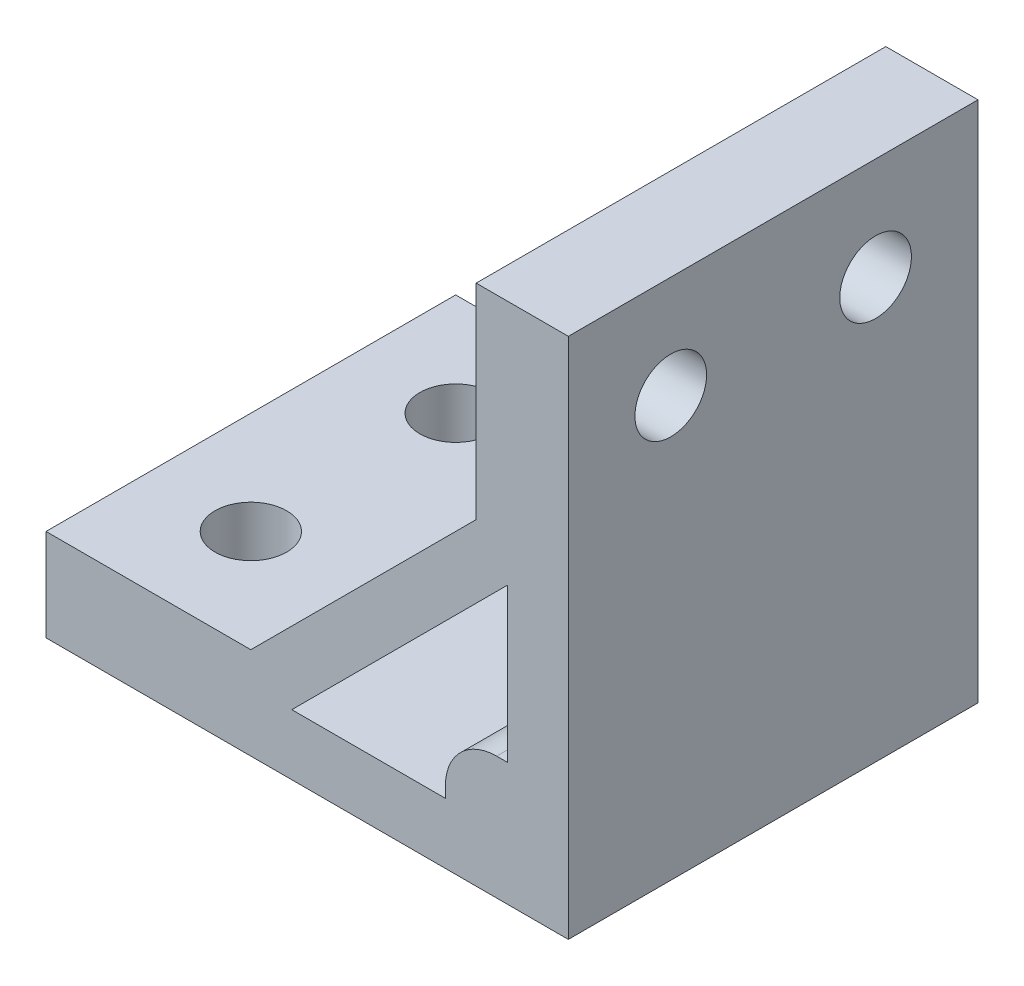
ISO-10303-21;
HEADER;
FILE_DESCRIPTION(('STEP AP214'),'2;1');
FILE_NAME('part.step','',(''),(''),'','','');
FILE_SCHEMA(('AUTOMOTIVE_DESIGN { 1 0 10303 214 1 1 1 1 }'));
ENDSEC;
DATA;
#1=APPLICATION_CONTEXT('core data for automotive mechanical design processes');
#2=APPLICATION_PROTOCOL_DEFINITION('international standard','automotive_design',2000,#1);
#3=PRODUCT_CONTEXT('',#1,'mechanical');
#4=PRODUCT('Part','Part','',(#3));
#5=PRODUCT_RELATED_PRODUCT_CATEGORY('part','',(#4));
#6=PRODUCT_DEFINITION_FORMATION('','',#4);
#7=PRODUCT_DEFINITION_CONTEXT('part definition',#1,'design');
#8=PRODUCT_DEFINITION('design','',#6,#7);
#9=PRODUCT_DEFINITION_SHAPE('','',#8);
#10=(LENGTH_UNIT() NAMED_UNIT(*) SI_UNIT(.MILLI.,.METRE.));
#11=(NAMED_UNIT(*) PLANE_ANGLE_UNIT() SI_UNIT($,.RADIAN.));
#12=(NAMED_UNIT(*) SI_UNIT($,.STERADIAN.) SOLID_ANGLE_UNIT());
#13=UNCERTAINTY_MEASURE_WITH_UNIT(LENGTH_MEASURE(1.E-05),#10,'distance_accuracy_value','');
#14=(GEOMETRIC_REPRESENTATION_CONTEXT(3) GLOBAL_UNCERTAINTY_ASSIGNED_CONTEXT((#13)) GLOBAL_UNIT_ASSIGNED_CONTEXT((#10,
#11,#12)) REPRESENTATION_CONTEXT('',''));
#15=CARTESIAN_POINT('',(0.,0.,0.));
#16=DIRECTION('',(0.,0.,1.));
#17=DIRECTION('',(1.,0.,0.));
#18=AXIS2_PLACEMENT_3D('',#15,#16,#17);
#19=CARTESIAN_POINT('',(0.,0.,40.));
#20=DIRECTION('',(0.,0.,1.));
#21=DIRECTION('',(1.,0.,0.));
#22=AXIS2_PLACEMENT_3D('',#19,#20,#21);
#23=PLANE('',#22);
#24=DIRECTION('',(1.,0.,0.));
#25=VECTOR('',#24,1.);
#26=CARTESIAN_POINT('',(-51.,0.,40.));
#27=LINE('',#26,#25);
#28=CARTESIAN_POINT('',(-51.,0.,40.));
#29=VERTEX_POINT('',#28);
#30=CARTESIAN_POINT('',(0.,0.,40.));
#31=VERTEX_POINT('',#30);
#32=EDGE_CURVE('E176',#29,#31,#27,.T.);
#33=ORIENTED_EDGE('',*,*,#32,.T.);
#34=DIRECTION('',(0.,1.,0.));
#35=VECTOR('',#34,1.);
#36=CARTESIAN_POINT('',(0.,0.,40.));
#37=LINE('',#36,#35);
#38=CARTESIAN_POINT('',(0.,51.,40.));
#39=VERTEX_POINT('',#38);
#40=EDGE_CURVE('E179',#31,#39,#37,.T.);
#41=ORIENTED_EDGE('',*,*,#40,.T.);
#42=DIRECTION('',(-1.,0.,0.));
#43=VECTOR('',#42,1.);
#44=CARTESIAN_POINT('',(0.,51.,40.));
#45=LINE('',#44,#43);
#46=CARTESIAN_POINT('',(-9.,51.,40.));
#47=VERTEX_POINT('',#46);
#48=EDGE_CURVE('E182',#39,#47,#45,.T.);
#49=ORIENTED_EDGE('',*,*,#48,.T.);
#50=DIRECTION('',(0.,-1.,0.));
#51=VECTOR('',#50,1.);
#52=CARTESIAN_POINT('',(-9.,51.,40.));
#53=LINE('',#52,#51);
#54=CARTESIAN_POINT('',(-9.,30.9999999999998,40.));
#55=VERTEX_POINT('',#54);
#56=EDGE_CURVE('E184',#47,#55,#53,.T.);
#57=ORIENTED_EDGE('',*,*,#56,.T.);
#58=DIRECTION('',(-0.707106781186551,-0.707106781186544,0.));
#59=VECTOR('',#58,1.);
#60=CARTESIAN_POINT('',(-9.,30.9999999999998,40.));
#61=LINE('',#60,#59);
#62=CARTESIAN_POINT('',(-31.,9.,40.));
#63=VERTEX_POINT('',#62);
#64=EDGE_CURVE('E186',#55,#63,#61,.T.);
#65=ORIENTED_EDGE('',*,*,#64,.T.);
#66=DIRECTION('',(-1.,0.,0.));
#67=VECTOR('',#66,1.);
#68=CARTESIAN_POINT('',(-31.,9.,40.));
#69=LINE('',#68,#67);
#70=CARTESIAN_POINT('',(-51.,9.,40.));
#71=VERTEX_POINT('',#70);
#72=EDGE_CURVE('E188',#63,#71,#69,.T.);
#73=ORIENTED_EDGE('',*,*,#72,.T.);
#74=DIRECTION('',(0.,-1.,0.));
#75=VECTOR('',#74,1.);
#76=CARTESIAN_POINT('',(-51.,9.,40.));
#77=LINE('',#76,#75);
#78=EDGE_CURVE('E190',#71,#29,#77,.T.);
#79=ORIENTED_EDGE('',*,*,#78,.T.);
#80=EDGE_LOOP('',(#33,#41,#49,#57,#65,#73,#79));
#81=FACE_BOUND('',#80,.T.);
#82=DIRECTION('',(1.,0.,0.));
#83=VECTOR('',#82,1.);
#84=CARTESIAN_POINT('',(-12.,12.,40.));
#85=LINE('',#84,#83);
#86=CARTESIAN_POINT('',(-7.,12.,40.));
#87=VERTEX_POINT('',#86);
#88=CARTESIAN_POINT('',(-5.92893218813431,12.,40.));
#89=VERTEX_POINT('',#88);
#90=EDGE_CURVE('E150',#87,#89,#85,.T.);
#91=ORIENTED_EDGE('',*,*,#90,.F.);
#92=CARTESIAN_POINT('',(-7.,7.,40.));
#93=DIRECTION('',(0.,0.,1.));
#94=DIRECTION('',(1.,0.,0.));
#95=AXIS2_PLACEMENT_3D('',#92,#93,#94);
#96=CIRCLE('',#95,5.);
#97=CARTESIAN_POINT('',(-12.,7.,40.));
#98=VERTEX_POINT('',#97);
#99=EDGE_CURVE('E11',#87,#98,#96,.T.);
#100=ORIENTED_EDGE('',*,*,#99,.T.);
#101=DIRECTION('',(0.,1.,0.));
#102=VECTOR('',#101,1.);
#103=CARTESIAN_POINT('',(-12.,5.92893218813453,40.));
#104=LINE('',#103,#102);
#105=CARTESIAN_POINT('',(-12.,5.92893218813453,40.));
#106=VERTEX_POINT('',#105);
#107=EDGE_CURVE('E137',#106,#98,#104,.T.);
#108=ORIENTED_EDGE('',*,*,#107,.F.);
#109=DIRECTION('',(1.,0.,0.));
#110=VECTOR('',#109,1.);
#111=CARTESIAN_POINT('',(-27.,5.92893218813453,40.));
#112=LINE('',#111,#110);
#113=CARTESIAN_POINT('',(-27.,5.92893218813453,40.));
#114=VERTEX_POINT('',#113);
#115=EDGE_CURVE('E127',#114,#106,#112,.T.);
#116=ORIENTED_EDGE('',*,*,#115,.F.);
#117=DIRECTION('',(-0.707106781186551,-0.707106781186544,0.));
#118=VECTOR('',#117,1.);
#119=CARTESIAN_POINT('',(-5.92893218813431,27.,40.));
#120=LINE('',#119,#118);
#121=CARTESIAN_POINT('',(-5.92893218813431,27.,40.));
#122=VERTEX_POINT('',#121);
#123=EDGE_CURVE('E158',#122,#114,#120,.T.);
#124=ORIENTED_EDGE('',*,*,#123,.F.);
#125=DIRECTION('',(0.,1.,0.));
#126=VECTOR('',#125,1.);
#127=CARTESIAN_POINT('',(-5.92893218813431,12.,40.));
#128=LINE('',#127,#126);
#129=EDGE_CURVE('E152',#89,#122,#128,.T.);
#130=ORIENTED_EDGE('',*,*,#129,.F.);
#131=EDGE_LOOP('',(#91,#100,#108,#116,#124,#130));
#132=FACE_BOUND('',#131,.T.);
#133=ADVANCED_FACE('F31',(#81,#132),#23,.T.);
#134=CARTESIAN_POINT('',(0.,0.,0.));
#135=DIRECTION('',(0.,0.,1.));
#136=DIRECTION('',(1.,0.,0.));
#137=AXIS2_PLACEMENT_3D('',#134,#135,#136);
#138=PLANE('',#137);
#139=DIRECTION('',(1.,0.,0.));
#140=VECTOR('',#139,1.);
#141=CARTESIAN_POINT('',(-51.,0.,0.));
#142=LINE('',#141,#140);
#143=CARTESIAN_POINT('',(-51.,0.,0.));
#144=VERTEX_POINT('',#143);
#145=CARTESIAN_POINT('',(0.,0.,0.));
#146=VERTEX_POINT('',#145);
#147=EDGE_CURVE('E146',#144,#146,#142,.T.);
#148=ORIENTED_EDGE('',*,*,#147,.F.);
#149=DIRECTION('',(0.,-1.,0.));
#150=VECTOR('',#149,1.);
#151=CARTESIAN_POINT('',(-51.,9.,0.));
#152=LINE('',#151,#150);
#153=CARTESIAN_POINT('',(-51.,9.,0.));
#154=VERTEX_POINT('',#153);
#155=EDGE_CURVE('E180',#154,#144,#152,.T.);
#156=ORIENTED_EDGE('',*,*,#155,.F.);
#157=DIRECTION('',(-1.,0.,0.));
#158=VECTOR('',#157,1.);
#159=CARTESIAN_POINT('',(-31.,9.,0.));
#160=LINE('',#159,#158);
#161=CARTESIAN_POINT('',(-31.,9.,0.));
#162=VERTEX_POINT('',#161);
#163=EDGE_CURVE('E203',#162,#154,#160,.T.);
#164=ORIENTED_EDGE('',*,*,#163,.F.);
#165=DIRECTION('',(-0.707106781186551,-0.707106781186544,0.));
#166=VECTOR('',#165,1.);
#167=CARTESIAN_POINT('',(-9.,30.9999999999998,0.));
#168=LINE('',#167,#166);
#169=CARTESIAN_POINT('',(-9.,30.9999999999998,0.));
#170=VERTEX_POINT('',#169);
#171=EDGE_CURVE('E201',#170,#162,#168,.T.);
#172=ORIENTED_EDGE('',*,*,#171,.F.);
#173=DIRECTION('',(0.,-1.,0.));
#174=VECTOR('',#173,1.);
#175=CARTESIAN_POINT('',(-9.,51.,0.));
#176=LINE('',#175,#174);
#177=CARTESIAN_POINT('',(-9.,51.,0.));
#178=VERTEX_POINT('',#177);
#179=EDGE_CURVE('E199',#178,#170,#176,.T.);
#180=ORIENTED_EDGE('',*,*,#179,.F.);
#181=DIRECTION('',(-1.,0.,0.));
#182=VECTOR('',#181,1.);
#183=CARTESIAN_POINT('',(0.,51.,0.));
#184=LINE('',#183,#182);
#185=CARTESIAN_POINT('',(0.,51.,0.));
#186=VERTEX_POINT('',#185);
#187=EDGE_CURVE('E197',#186,#178,#184,.T.);
#188=ORIENTED_EDGE('',*,*,#187,.F.);
#189=DIRECTION('',(0.,1.,0.));
#190=VECTOR('',#189,1.);
#191=CARTESIAN_POINT('',(0.,0.,0.));
#192=LINE('',#191,#190);
#193=EDGE_CURVE('E195',#146,#186,#192,.T.);
#194=ORIENTED_EDGE('',*,*,#193,.F.);
#195=EDGE_LOOP('',(#148,#156,#164,#172,#180,#188,#194));
#196=FACE_BOUND('',#195,.T.);
#197=DIRECTION('',(0.,1.,0.));
#198=VECTOR('',#197,1.);
#199=CARTESIAN_POINT('',(-12.,5.92893218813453,0.));
#200=LINE('',#199,#198);
#201=CARTESIAN_POINT('',(-12.,5.92893218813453,0.));
#202=VERTEX_POINT('',#201);
#203=CARTESIAN_POINT('',(-12.,7.,0.));
#204=VERTEX_POINT('',#203);
#205=EDGE_CURVE('E145',#202,#204,#200,.T.);
#206=ORIENTED_EDGE('',*,*,#205,.T.);
#207=CARTESIAN_POINT('',(-7.,7.,0.));
#208=DIRECTION('',(0.,0.,1.));
#209=DIRECTION('',(1.,0.,0.));
#210=AXIS2_PLACEMENT_3D('',#207,#208,#209);
#211=CIRCLE('',#210,5.);
#212=CARTESIAN_POINT('',(-7.,12.,0.));
#213=VERTEX_POINT('',#212);
#214=EDGE_CURVE('E55',#204,#213,#211,.F.);
#215=ORIENTED_EDGE('',*,*,#214,.T.);
#216=DIRECTION('',(1.,0.,0.));
#217=VECTOR('',#216,1.);
#218=CARTESIAN_POINT('',(-12.,12.,0.));
#219=LINE('',#218,#217);
#220=CARTESIAN_POINT('',(-5.92893218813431,12.,0.));
#221=VERTEX_POINT('',#220);
#222=EDGE_CURVE('E164',#213,#221,#219,.T.);
#223=ORIENTED_EDGE('',*,*,#222,.T.);
#224=DIRECTION('',(0.,1.,0.));
#225=VECTOR('',#224,1.);
#226=CARTESIAN_POINT('',(-5.92893218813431,12.,0.));
#227=LINE('',#226,#225);
#228=CARTESIAN_POINT('',(-5.92893218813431,27.,0.));
#229=VERTEX_POINT('',#228);
#230=EDGE_CURVE('E166',#221,#229,#227,.T.);
#231=ORIENTED_EDGE('',*,*,#230,.T.);
#232=DIRECTION('',(-0.707106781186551,-0.707106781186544,0.));
#233=VECTOR('',#232,1.);
#234=CARTESIAN_POINT('',(-5.92893218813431,27.,0.));
#235=LINE('',#234,#233);
#236=CARTESIAN_POINT('',(-27.,5.92893218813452,0.));
#237=VERTEX_POINT('',#236);
#238=EDGE_CURVE('E138',#229,#237,#235,.T.);
#239=ORIENTED_EDGE('',*,*,#238,.T.);
#240=DIRECTION('',(1.,0.,0.));
#241=VECTOR('',#240,1.);
#242=CARTESIAN_POINT('',(-27.,5.92893218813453,0.));
#243=LINE('',#242,#241);
#244=EDGE_CURVE('E160',#237,#202,#243,.T.);
#245=ORIENTED_EDGE('',*,*,#244,.T.);
#246=EDGE_LOOP('',(#206,#215,#223,#231,#239,#245));
#247=FACE_BOUND('',#246,.T.);
#248=ADVANCED_FACE('F272',(#196,#247),#138,.F.);
#249=CARTESIAN_POINT('',(-51.,0.,40.));
#250=DIRECTION('',(0.,1.,0.));
#251=DIRECTION('',(0.,0.,1.));
#252=AXIS2_PLACEMENT_3D('',#249,#250,#251);
#253=PLANE('',#252);
#254=CARTESIAN_POINT('',(-41.,0.,30.));
#255=DIRECTION('',(0.,-1.,0.));
#256=DIRECTION('',(0.,0.,-1.));
#257=AXIS2_PLACEMENT_3D('',#254,#255,#256);
#258=CIRCLE('',#257,3.5);
#259=CARTESIAN_POINT('',(-41.,0.,26.5));
#260=VERTEX_POINT('',#259);
#261=EDGE_CURVE('E248',#260,#260,#258,.T.);
#262=ORIENTED_EDGE('',*,*,#261,.F.);
#263=EDGE_LOOP('',(#262));
#264=FACE_BOUND('',#263,.T.);
#265=CARTESIAN_POINT('',(-41.,0.,10.));
#266=DIRECTION('',(0.,-1.,0.));
#267=DIRECTION('',(0.,0.,-1.));
#268=AXIS2_PLACEMENT_3D('',#265,#266,#267);
#269=CIRCLE('',#268,3.5);
#270=CARTESIAN_POINT('',(-41.,0.,6.5));
#271=VERTEX_POINT('',#270);
#272=EDGE_CURVE('E238',#271,#271,#269,.T.);
#273=ORIENTED_EDGE('',*,*,#272,.F.);
#274=EDGE_LOOP('',(#273));
#275=FACE_BOUND('',#274,.T.);
#276=ORIENTED_EDGE('',*,*,#147,.T.);
#277=DIRECTION('',(0.,0.,-1.));
#278=VECTOR('',#277,1.);
#279=CARTESIAN_POINT('',(0.,0.,40.));
#280=LINE('',#279,#278);
#281=EDGE_CURVE('E223',#31,#146,#280,.T.);
#282=ORIENTED_EDGE('',*,*,#281,.F.);
#283=ORIENTED_EDGE('',*,*,#32,.F.);
#284=DIRECTION('',(0.,0.,-1.));
#285=VECTOR('',#284,1.);
#286=CARTESIAN_POINT('',(-51.,0.,40.));
#287=LINE('',#286,#285);
#288=EDGE_CURVE('E192',#29,#144,#287,.T.);
#289=ORIENTED_EDGE('',*,*,#288,.T.);
#290=EDGE_LOOP('',(#276,#282,#283,#289));
#291=FACE_BOUND('',#290,.T.);
#292=ADVANCED_FACE('F260',(#264,#275,#291),#253,.F.);
#293=CARTESIAN_POINT('',(0.,0.,40.));
#294=DIRECTION('',(-1.,0.,0.));
#295=DIRECTION('',(0.,0.,1.));
#296=AXIS2_PLACEMENT_3D('',#293,#294,#295);
#297=PLANE('',#296);
#298=CARTESIAN_POINT('',(0.,41.,30.));
#299=DIRECTION('',(1.,0.,0.));
#300=DIRECTION('',(0.,0.,-1.));
#301=AXIS2_PLACEMENT_3D('',#298,#299,#300);
#302=CIRCLE('',#301,3.5);
#303=CARTESIAN_POINT('',(0.,41.,26.5));
#304=VERTEX_POINT('',#303);
#305=EDGE_CURVE('E235',#304,#304,#302,.T.);
#306=ORIENTED_EDGE('',*,*,#305,.F.);
#307=EDGE_LOOP('',(#306));
#308=FACE_BOUND('',#307,.T.);
#309=CARTESIAN_POINT('',(0.,41.,10.));
#310=DIRECTION('',(1.,0.,0.));
#311=DIRECTION('',(0.,0.,-1.));
#312=AXIS2_PLACEMENT_3D('',#309,#310,#311);
#313=CIRCLE('',#312,3.5);
#314=CARTESIAN_POINT('',(0.,41.,6.5));
#315=VERTEX_POINT('',#314);
#316=EDGE_CURVE('E232',#315,#315,#313,.T.);
#317=ORIENTED_EDGE('',*,*,#316,.F.);
#318=EDGE_LOOP('',(#317));
#319=FACE_BOUND('',#318,.T.);
#320=ORIENTED_EDGE('',*,*,#193,.T.);
#321=DIRECTION('',(0.,0.,-1.));
#322=VECTOR('',#321,1.);
#323=CARTESIAN_POINT('',(0.,51.,40.));
#324=LINE('',#323,#322);
#325=EDGE_CURVE('E220',#39,#186,#324,.T.);
#326=ORIENTED_EDGE('',*,*,#325,.F.);
#327=ORIENTED_EDGE('',*,*,#40,.F.);
#328=ORIENTED_EDGE('',*,*,#281,.T.);
#329=EDGE_LOOP('',(#320,#326,#327,#328));
#330=FACE_BOUND('',#329,.T.);
#331=ADVANCED_FACE('F256',(#308,#319,#330),#297,.F.);
#332=CARTESIAN_POINT('',(0.,51.,40.));
#333=DIRECTION('',(0.,-1.,0.));
#334=DIRECTION('',(0.,0.,-1.));
#335=AXIS2_PLACEMENT_3D('',#332,#333,#334);
#336=PLANE('',#335);
#337=ORIENTED_EDGE('',*,*,#187,.T.);
#338=DIRECTION('',(0.,0.,-1.));
#339=VECTOR('',#338,1.);
#340=CARTESIAN_POINT('',(-9.,51.,40.));
#341=LINE('',#340,#339);
#342=EDGE_CURVE('E217',#47,#178,#341,.T.);
#343=ORIENTED_EDGE('',*,*,#342,.F.);
#344=ORIENTED_EDGE('',*,*,#48,.F.);
#345=ORIENTED_EDGE('',*,*,#325,.T.);
#346=EDGE_LOOP('',(#337,#343,#344,#345));
#347=FACE_BOUND('',#346,.T.);
#348=ADVANCED_FACE('F259',(#347),#336,.F.);
#349=CARTESIAN_POINT('',(-9.,51.,40.));
#350=DIRECTION('',(1.,0.,0.));
#351=DIRECTION('',(0.,1.,0.));
#352=AXIS2_PLACEMENT_3D('',#349,#350,#351);
#353=PLANE('',#352);
#354=CARTESIAN_POINT('',(-9.,41.,30.));
#355=DIRECTION('',(1.,0.,0.));
#356=DIRECTION('',(0.,1.,0.));
#357=AXIS2_PLACEMENT_3D('',#354,#355,#356);
#358=CIRCLE('',#357,3.5);
#359=CARTESIAN_POINT('',(-9.,44.5,30.));
#360=VERTEX_POINT('',#359);
#361=EDGE_CURVE('E233',#360,#360,#358,.T.);
#362=ORIENTED_EDGE('',*,*,#361,.T.);
#363=EDGE_LOOP('',(#362));
#364=FACE_BOUND('',#363,.T.);
#365=CARTESIAN_POINT('',(-9.,41.,10.));
#366=DIRECTION('',(1.,0.,0.));
#367=DIRECTION('',(0.,1.,0.));
#368=AXIS2_PLACEMENT_3D('',#365,#366,#367);
#369=CIRCLE('',#368,3.5);
#370=CARTESIAN_POINT('',(-9.,44.5,10.));
#371=VERTEX_POINT('',#370);
#372=EDGE_CURVE('E162',#371,#371,#369,.T.);
#373=ORIENTED_EDGE('',*,*,#372,.T.);
#374=EDGE_LOOP('',(#373));
#375=FACE_BOUND('',#374,.T.);
#376=ORIENTED_EDGE('',*,*,#179,.T.);
#377=DIRECTION('',(0.,0.,-1.));
#378=VECTOR('',#377,1.);
#379=CARTESIAN_POINT('',(-9.,30.9999999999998,40.));
#380=LINE('',#379,#378);
#381=EDGE_CURVE('E214',#55,#170,#380,.T.);
#382=ORIENTED_EDGE('',*,*,#381,.F.);
#383=ORIENTED_EDGE('',*,*,#56,.F.);
#384=ORIENTED_EDGE('',*,*,#342,.T.);
#385=EDGE_LOOP('',(#376,#382,#383,#384));
#386=FACE_BOUND('',#385,.T.);
#387=ADVANCED_FACE('F277',(#364,#375,#386),#353,.F.);
#388=CARTESIAN_POINT('',(-9.,30.9999999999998,40.));
#389=DIRECTION('',(0.707106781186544,-0.707106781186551,0.));
#390=DIRECTION('',(0.707106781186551,0.707106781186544,0.));
#391=AXIS2_PLACEMENT_3D('',#388,#389,#390);
#392=PLANE('',#391);
#393=ORIENTED_EDGE('',*,*,#171,.T.);
#394=DIRECTION('',(0.,0.,-1.));
#395=VECTOR('',#394,1.);
#396=CARTESIAN_POINT('',(-31.,9.,40.));
#397=LINE('',#396,#395);
#398=EDGE_CURVE('E211',#63,#162,#397,.T.);
#399=ORIENTED_EDGE('',*,*,#398,.F.);
#400=ORIENTED_EDGE('',*,*,#64,.F.);
#401=ORIENTED_EDGE('',*,*,#381,.T.);
#402=EDGE_LOOP('',(#393,#399,#400,#401));
#403=FACE_BOUND('',#402,.T.);
#404=ADVANCED_FACE('F281',(#403),#392,.F.);
#405=CARTESIAN_POINT('',(-31.,9.,40.));
#406=DIRECTION('',(0.,-1.,0.));
#407=DIRECTION('',(1.,0.,0.));
#408=AXIS2_PLACEMENT_3D('',#405,#406,#407);
#409=PLANE('',#408);
#410=CARTESIAN_POINT('',(-41.,9.,30.));
#411=DIRECTION('',(0.,-1.,0.));
#412=DIRECTION('',(1.,0.,0.));
#413=AXIS2_PLACEMENT_3D('',#410,#411,#412);
#414=CIRCLE('',#413,3.5);
#415=CARTESIAN_POINT('',(-37.5,9.,30.));
#416=VERTEX_POINT('',#415);
#417=EDGE_CURVE('E35',#416,#416,#414,.T.);
#418=ORIENTED_EDGE('',*,*,#417,.T.);
#419=EDGE_LOOP('',(#418));
#420=FACE_BOUND('',#419,.T.);
#421=CARTESIAN_POINT('',(-41.,9.,10.));
#422=DIRECTION('',(0.,-1.,0.));
#423=DIRECTION('',(1.,0.,0.));
#424=AXIS2_PLACEMENT_3D('',#421,#422,#423);
#425=CIRCLE('',#424,3.5);
#426=CARTESIAN_POINT('',(-37.5,9.,10.));
#427=VERTEX_POINT('',#426);
#428=EDGE_CURVE('E236',#427,#427,#425,.T.);
#429=ORIENTED_EDGE('',*,*,#428,.T.);
#430=EDGE_LOOP('',(#429));
#431=FACE_BOUND('',#430,.T.);
#432=ORIENTED_EDGE('',*,*,#163,.T.);
#433=DIRECTION('',(0.,0.,-1.));
#434=VECTOR('',#433,1.);
#435=CARTESIAN_POINT('',(-51.,9.,40.));
#436=LINE('',#435,#434);
#437=EDGE_CURVE('E208',#71,#154,#436,.T.);
#438=ORIENTED_EDGE('',*,*,#437,.F.);
#439=ORIENTED_EDGE('',*,*,#72,.F.);
#440=ORIENTED_EDGE('',*,*,#398,.T.);
#441=EDGE_LOOP('',(#432,#438,#439,#440));
#442=FACE_BOUND('',#441,.T.);
#443=ADVANCED_FACE('F294',(#420,#431,#442),#409,.F.);
#444=CARTESIAN_POINT('',(-51.,9.,40.));
#445=DIRECTION('',(1.,0.,0.));
#446=DIRECTION('',(0.,1.,0.));
#447=AXIS2_PLACEMENT_3D('',#444,#445,#446);
#448=PLANE('',#447);
#449=ORIENTED_EDGE('',*,*,#155,.T.);
#450=ORIENTED_EDGE('',*,*,#288,.F.);
#451=ORIENTED_EDGE('',*,*,#78,.F.);
#452=ORIENTED_EDGE('',*,*,#437,.T.);
#453=EDGE_LOOP('',(#449,#450,#451,#452));
#454=FACE_BOUND('',#453,.T.);
#455=ADVANCED_FACE('F292',(#454),#448,.F.);
#456=CARTESIAN_POINT('',(-27.,5.92893218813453,40.));
#457=DIRECTION('',(0.,1.,0.));
#458=DIRECTION('',(-1.,0.,0.));
#459=AXIS2_PLACEMENT_3D('',#456,#457,#458);
#460=PLANE('',#459);
#461=ORIENTED_EDGE('',*,*,#244,.F.);
#462=DIRECTION('',(0.,0.,-1.));
#463=VECTOR('',#462,1.);
#464=CARTESIAN_POINT('',(-27.,5.92893218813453,40.));
#465=LINE('',#464,#463);
#466=EDGE_CURVE('E133',#114,#237,#465,.T.);
#467=ORIENTED_EDGE('',*,*,#466,.F.);
#468=ORIENTED_EDGE('',*,*,#115,.T.);
#469=DIRECTION('',(0.,0.,-1.));
#470=VECTOR('',#469,1.);
#471=CARTESIAN_POINT('',(-12.,5.92893218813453,40.));
#472=LINE('',#471,#470);
#473=EDGE_CURVE('E130',#106,#202,#472,.T.);
#474=ORIENTED_EDGE('',*,*,#473,.T.);
#475=EDGE_LOOP('',(#461,#467,#468,#474));
#476=FACE_BOUND('',#475,.T.);
#477=ADVANCED_FACE('F129',(#476),#460,.T.);
#478=CARTESIAN_POINT('',(-12.,5.92893218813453,40.));
#479=DIRECTION('',(-1.,0.,0.));
#480=DIRECTION('',(0.,0.,1.));
#481=AXIS2_PLACEMENT_3D('',#478,#479,#480);
#482=PLANE('',#481);
#483=ORIENTED_EDGE('',*,*,#107,.T.);
#484=DIRECTION('',(0.,0.,-1.));
#485=VECTOR('',#484,1.);
#486=CARTESIAN_POINT('',(-12.,7.,40.));
#487=LINE('',#486,#485);
#488=EDGE_CURVE('E226',#98,#204,#487,.T.);
#489=ORIENTED_EDGE('',*,*,#488,.T.);
#490=ORIENTED_EDGE('',*,*,#205,.F.);
#491=ORIENTED_EDGE('',*,*,#473,.F.);
#492=EDGE_LOOP('',(#483,#489,#490,#491));
#493=FACE_BOUND('',#492,.T.);
#494=ADVANCED_FACE('F142',(#493),#482,.T.);
#495=CARTESIAN_POINT('',(-12.,12.,40.));
#496=DIRECTION('',(0.,1.,0.));
#497=DIRECTION('',(0.,0.,1.));
#498=AXIS2_PLACEMENT_3D('',#495,#496,#497);
#499=PLANE('',#498);
#500=ORIENTED_EDGE('',*,*,#222,.F.);
#501=DIRECTION('',(0.,0.,-1.));
#502=VECTOR('',#501,1.);
#503=CARTESIAN_POINT('',(-7.,12.,40.));
#504=LINE('',#503,#502);
#505=EDGE_CURVE('E40',#213,#87,#504,.F.);
#506=ORIENTED_EDGE('',*,*,#505,.T.);
#507=ORIENTED_EDGE('',*,*,#90,.T.);
#508=DIRECTION('',(0.,0.,-1.));
#509=VECTOR('',#508,1.);
#510=CARTESIAN_POINT('',(-5.92893218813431,12.,40.));
#511=LINE('',#510,#509);
#512=EDGE_CURVE('E147',#89,#221,#511,.T.);
#513=ORIENTED_EDGE('',*,*,#512,.T.);
#514=EDGE_LOOP('',(#500,#506,#507,#513));
#515=FACE_BOUND('',#514,.T.);
#516=ADVANCED_FACE('F315',(#515),#499,.T.);
#517=CARTESIAN_POINT('',(-5.92893218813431,12.,40.));
#518=DIRECTION('',(-1.,0.,0.));
#519=DIRECTION('',(0.,-1.,0.));
#520=AXIS2_PLACEMENT_3D('',#517,#518,#519);
#521=PLANE('',#520);
#522=ORIENTED_EDGE('',*,*,#230,.F.);
#523=ORIENTED_EDGE('',*,*,#512,.F.);
#524=ORIENTED_EDGE('',*,*,#129,.T.);
#525=DIRECTION('',(0.,0.,-1.));
#526=VECTOR('',#525,1.);
#527=CARTESIAN_POINT('',(-5.92893218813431,27.,40.));
#528=LINE('',#527,#526);
#529=EDGE_CURVE('E172',#122,#229,#528,.T.);
#530=ORIENTED_EDGE('',*,*,#529,.T.);
#531=EDGE_LOOP('',(#522,#523,#524,#530));
#532=FACE_BOUND('',#531,.T.);
#533=ADVANCED_FACE('F318',(#532),#521,.T.);
#534=CARTESIAN_POINT('',(-5.92893218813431,27.,40.));
#535=DIRECTION('',(0.707106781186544,-0.707106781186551,0.));
#536=DIRECTION('',(0.707106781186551,0.707106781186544,0.));
#537=AXIS2_PLACEMENT_3D('',#534,#535,#536);
#538=PLANE('',#537);
#539=ORIENTED_EDGE('',*,*,#238,.F.);
#540=ORIENTED_EDGE('',*,*,#529,.F.);
#541=ORIENTED_EDGE('',*,*,#123,.T.);
#542=ORIENTED_EDGE('',*,*,#466,.T.);
#543=EDGE_LOOP('',(#539,#540,#541,#542));
#544=FACE_BOUND('',#543,.T.);
#545=ADVANCED_FACE('F321',(#544),#538,.T.);
#546=CARTESIAN_POINT('',(-7.,7.,40.));
#547=DIRECTION('',(0.,0.,-1.));
#548=DIRECTION('',(-1.,0.,0.));
#549=AXIS2_PLACEMENT_3D('',#546,#547,#548);
#550=CYLINDRICAL_SURFACE('',#549,5.);
#551=ORIENTED_EDGE('',*,*,#99,.F.);
#552=ORIENTED_EDGE('',*,*,#505,.F.);
#553=ORIENTED_EDGE('',*,*,#214,.F.);
#554=ORIENTED_EDGE('',*,*,#488,.F.);
#555=EDGE_LOOP('',(#551,#552,#553,#554));
#556=FACE_BOUND('',#555,.T.);
#557=ADVANCED_FACE('F33',(#556),#550,.T.);
#558=CARTESIAN_POINT('',(-40.,41.,10.));
#559=DIRECTION('',(1.,0.,0.));
#560=DIRECTION('',(0.,0.,-1.));
#561=AXIS2_PLACEMENT_3D('',#558,#559,#560);
#562=CYLINDRICAL_SURFACE('',#561,3.5);
#563=ORIENTED_EDGE('',*,*,#316,.T.);
#564=EDGE_LOOP('',(#563));
#565=FACE_BOUND('',#564,.T.);
#566=ORIENTED_EDGE('',*,*,#372,.F.);
#567=EDGE_LOOP('',(#566));
#568=FACE_BOUND('',#567,.T.);
#569=ADVANCED_FACE('F253',(#565,#568),#562,.F.);
#570=CARTESIAN_POINT('',(-40.,41.,30.));
#571=DIRECTION('',(1.,0.,0.));
#572=DIRECTION('',(0.,0.,-1.));
#573=AXIS2_PLACEMENT_3D('',#570,#571,#572);
#574=CYLINDRICAL_SURFACE('',#573,3.5);
#575=ORIENTED_EDGE('',*,*,#305,.T.);
#576=EDGE_LOOP('',(#575));
#577=FACE_BOUND('',#576,.T.);
#578=ORIENTED_EDGE('',*,*,#361,.F.);
#579=EDGE_LOOP('',(#578));
#580=FACE_BOUND('',#579,.T.);
#581=ADVANCED_FACE('F328',(#577,#580),#574,.F.);
#582=CARTESIAN_POINT('',(-41.,40.,10.));
#583=DIRECTION('',(0.,-1.,0.));
#584=DIRECTION('',(0.,0.,-1.));
#585=AXIS2_PLACEMENT_3D('',#582,#583,#584);
#586=CYLINDRICAL_SURFACE('',#585,3.5);
#587=ORIENTED_EDGE('',*,*,#272,.T.);
#588=EDGE_LOOP('',(#587));
#589=FACE_BOUND('',#588,.T.);
#590=ORIENTED_EDGE('',*,*,#428,.F.);
#591=EDGE_LOOP('',(#590));
#592=FACE_BOUND('',#591,.T.);
#593=ADVANCED_FACE('F331',(#589,#592),#586,.F.);
#594=CARTESIAN_POINT('',(-41.,40.,30.));
#595=DIRECTION('',(0.,-1.,0.));
#596=DIRECTION('',(0.,0.,-1.));
#597=AXIS2_PLACEMENT_3D('',#594,#595,#596);
#598=CYLINDRICAL_SURFACE('',#597,3.5);
#599=ORIENTED_EDGE('',*,*,#261,.T.);
#600=EDGE_LOOP('',(#599));
#601=FACE_BOUND('',#600,.T.);
#602=ORIENTED_EDGE('',*,*,#417,.F.);
#603=EDGE_LOOP('',(#602));
#604=FACE_BOUND('',#603,.T.);
#605=ADVANCED_FACE('F335',(#601,#604),#598,.F.);
#606=CLOSED_SHELL('',(#133,#248,#292,#331,#348,#387,#404,#443,#455,#477,#494,#516,#533,#545,
#557,#569,#581,#593,#605));
#607=MANIFOLD_SOLID_BREP('B2',#606);
#608=ADVANCED_BREP_SHAPE_REPRESENTATION('',(#18,#607),#14);
#609=SHAPE_DEFINITION_REPRESENTATION(#9,#608);
ENDSEC;
END-ISO-10303-21;
